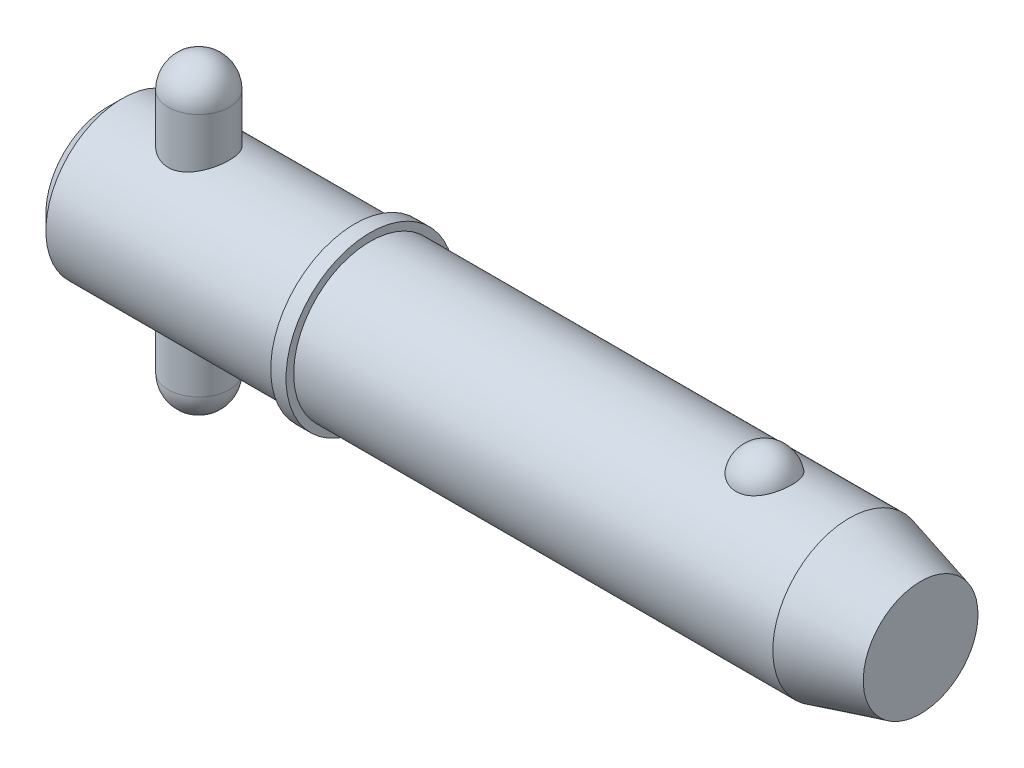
ISO-10303-21;
HEADER;
FILE_DESCRIPTION(('STEP AP214'),'2;1');
FILE_NAME('part.step','',(''),(''),'','','');
FILE_SCHEMA(('AUTOMOTIVE_DESIGN { 1 0 10303 214 1 1 1 1 }'));
ENDSEC;
DATA;
#1=APPLICATION_CONTEXT('core data for automotive mechanical design processes');
#2=APPLICATION_PROTOCOL_DEFINITION('international standard','automotive_design',2000,#1);
#3=PRODUCT_CONTEXT('',#1,'mechanical');
#4=PRODUCT('Part','Part','',(#3));
#5=PRODUCT_RELATED_PRODUCT_CATEGORY('part','',(#4));
#6=PRODUCT_DEFINITION_FORMATION('','',#4);
#7=PRODUCT_DEFINITION_CONTEXT('part definition',#1,'design');
#8=PRODUCT_DEFINITION('design','',#6,#7);
#9=PRODUCT_DEFINITION_SHAPE('','',#8);
#10=(LENGTH_UNIT() NAMED_UNIT(*) SI_UNIT(.MILLI.,.METRE.));
#11=(NAMED_UNIT(*) PLANE_ANGLE_UNIT() SI_UNIT($,.RADIAN.));
#12=(NAMED_UNIT(*) SI_UNIT($,.STERADIAN.) SOLID_ANGLE_UNIT());
#13=UNCERTAINTY_MEASURE_WITH_UNIT(LENGTH_MEASURE(1.E-05),#10,'distance_accuracy_value','');
#14=(GEOMETRIC_REPRESENTATION_CONTEXT(3) GLOBAL_UNCERTAINTY_ASSIGNED_CONTEXT((#13)) GLOBAL_UNIT_ASSIGNED_CONTEXT((#10,
#11,#12)) REPRESENTATION_CONTEXT('',''));
#15=CARTESIAN_POINT('',(0.,0.,0.));
#16=DIRECTION('',(0.,0.,1.));
#17=DIRECTION('',(1.,0.,0.));
#18=AXIS2_PLACEMENT_3D('',#15,#16,#17);
#19=CARTESIAN_POINT('',(9.525,15.875,0.));
#20=DIRECTION('',(0.,-1.,0.));
#21=DIRECTION('',(0.,0.,-1.));
#22=AXIS2_PLACEMENT_3D('',#19,#20,#21);
#23=CYLINDRICAL_SURFACE('',#22,3.175);
#24=CARTESIAN_POINT('',(9.525,-12.7,0.));
#25=DIRECTION('',(0.,-1.,0.));
#26=DIRECTION('',(0.,0.,-1.));
#27=AXIS2_PLACEMENT_3D('',#24,#25,#26);
#28=CIRCLE('',#27,3.175);
#29=CARTESIAN_POINT('',(9.525,-12.7,-3.175));
#30=VERTEX_POINT('',#29);
#31=EDGE_CURVE('P0_E10',#30,#30,#28,.F.);
#32=ORIENTED_EDGE('',*,*,#31,.T.);
#33=EDGE_LOOP('',(#32));
#34=FACE_BOUND('',#33,.T.);
#35=CARTESIAN_POINT('',(9.525,12.7,0.));
#36=DIRECTION('',(0.,-1.,0.));
#37=DIRECTION('',(0.,0.,-1.));
#38=AXIS2_PLACEMENT_3D('',#35,#36,#37);
#39=CIRCLE('',#38,3.175);
#40=CARTESIAN_POINT('',(9.525,12.7,-3.175));
#41=VERTEX_POINT('',#40);
#42=EDGE_CURVE('P0_E21',#41,#41,#39,.T.);
#43=ORIENTED_EDGE('',*,*,#42,.T.);
#44=EDGE_LOOP('',(#43));
#45=FACE_BOUND('',#44,.T.);
#46=ADVANCED_FACE('P0_F14',(#34,#45),#23,.T.);
#47=CARTESIAN_POINT('',(9.525,-12.7,0.));
#48=DIRECTION('',(0.,0.,1.));
#49=DIRECTION('',(1.,0.,0.));
#50=AXIS2_PLACEMENT_3D('',#47,#48,#49);
#51=SPHERICAL_SURFACE('',#50,3.175);
#52=CARTESIAN_POINT('',(9.525,-12.7,0.));
#53=DIRECTION('',(0.,-1.,0.));
#54=DIRECTION('',(0.,0.,-1.));
#55=AXIS2_PLACEMENT_3D('',#52,#53,#54);
#56=SPHERICAL_SURFACE('',#55,3.175);
#57=ORIENTED_EDGE('',*,*,#31,.F.);
#58=EDGE_LOOP('',(#57));
#59=FACE_BOUND('',#58,.T.);
#60=ADVANCED_FACE('P0_F29',(#59),#56,.T.);
#61=CARTESIAN_POINT('',(9.525,12.7,0.));
#62=DIRECTION('',(0.,0.,1.));
#63=DIRECTION('',(1.,0.,0.));
#64=AXIS2_PLACEMENT_3D('',#61,#62,#63);
#65=SPHERICAL_SURFACE('',#64,3.175);
#66=CARTESIAN_POINT('',(9.525,12.7,0.));
#67=DIRECTION('',(0.,-1.,0.));
#68=DIRECTION('',(0.,0.,-1.));
#69=AXIS2_PLACEMENT_3D('',#66,#67,#68);
#70=SPHERICAL_SURFACE('',#69,3.175);
#71=ORIENTED_EDGE('',*,*,#42,.F.);
#72=EDGE_LOOP('',(#71));
#73=FACE_BOUND('',#72,.T.);
#74=ADVANCED_FACE('P0_F16',(#73),#70,.T.);
#75=CLOSED_SHELL('',(#46,#60,#74));
#76=MANIFOLD_SOLID_BREP('P0_B1',#75);
#77=CARTESIAN_POINT('',(0.,0.,0.));
#78=DIRECTION('',(1.,0.,0.));
#79=DIRECTION('',(0.,0.,-1.));
#80=AXIS2_PLACEMENT_3D('',#77,#78,#79);
#81=CYLINDRICAL_SURFACE('',#80,7.94);
#82=CARTESIAN_POINT('',(77.0518791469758,0.,0.));
#83=DIRECTION('',(1.,0.,0.));
#84=DIRECTION('',(0.,0.,-1.));
#85=AXIS2_PLACEMENT_3D('',#82,#83,#84);
#86=CIRCLE('',#85,7.94);
#87=CARTESIAN_POINT('',(77.0518791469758,0.,-7.94));
#88=VERTEX_POINT('',#87);
#89=EDGE_CURVE('P1_E81',#88,#88,#86,.T.);
#90=ORIENTED_EDGE('',*,*,#89,.F.);
#91=EDGE_LOOP('',(#90));
#92=FACE_BOUND('',#91,.T.);
#93=CARTESIAN_POINT('',(27.31,0.,0.));
#94=DIRECTION('',(1.,0.,0.));
#95=DIRECTION('',(0.,0.,-1.));
#96=AXIS2_PLACEMENT_3D('',#93,#94,#95);
#97=CIRCLE('',#96,7.94);
#98=CARTESIAN_POINT('',(27.31,0.,-7.94));
#99=VERTEX_POINT('',#98);
#100=EDGE_CURVE('P1_E85',#99,#99,#97,.T.);
#101=ORIENTED_EDGE('',*,*,#100,.T.);
#102=EDGE_LOOP('',(#101));
#103=FACE_BOUND('',#102,.T.);
#104=CARTESIAN_POINT('',(68.2449074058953,7.37767842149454,2.93486986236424));
#105=CARTESIAN_POINT('',(68.0927496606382,7.37767329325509,2.9348750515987));
#106=CARTESIAN_POINT('',(67.9406329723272,7.38258419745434,2.92262454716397));
#107=CARTESIAN_POINT('',(67.6409284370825,7.40163229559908,2.87404196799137));
#108=CARTESIAN_POINT('',(67.4933394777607,7.41576720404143,2.83771585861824));
#109=CARTESIAN_POINT('',(67.2070187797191,7.45161576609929,2.74218769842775));
#110=CARTESIAN_POINT('',(67.0682745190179,7.47331841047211,2.68301886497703));
#111=CARTESIAN_POINT('',(66.8028822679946,7.52194082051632,2.54350967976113));
#112=CARTESIAN_POINT('',(66.6762366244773,7.54886159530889,2.46316523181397));
#113=CARTESIAN_POINT('',(66.4345349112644,7.60594671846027,2.28090375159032));
#114=CARTESIAN_POINT('',(66.3199065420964,7.63618114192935,2.1784421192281));
#115=CARTESIAN_POINT('',(66.1088787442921,7.69614046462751,1.95608495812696));
#116=CARTESIAN_POINT('',(66.0124826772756,7.72586526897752,1.83618622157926));
#117=CARTESIAN_POINT('',(65.8359381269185,7.78314821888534,1.57628086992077));
#118=CARTESIAN_POINT('',(65.7567072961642,7.81055035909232,1.43561546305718));
#119=CARTESIAN_POINT('',(65.6217979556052,7.85879631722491,1.14236334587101));
#120=CARTESIAN_POINT('',(65.5661216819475,7.87963951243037,0.98977550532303));
#121=CARTESIAN_POINT('',(65.4788121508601,7.91289645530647,0.674619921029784));
#122=CARTESIAN_POINT('',(65.4475309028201,7.92518652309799,0.511941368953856));
#123=CARTESIAN_POINT('',(65.4109756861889,7.93958930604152,0.18324773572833));
#124=CARTESIAN_POINT('',(65.4057012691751,7.94170219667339,0.0172327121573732));
#125=CARTESIAN_POINT('',(65.4212311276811,7.93554931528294,-0.312672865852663));
#126=CARTESIAN_POINT('',(65.4419253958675,7.92732732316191,-0.476569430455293));
#127=CARTESIAN_POINT('',(65.5087865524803,7.90141534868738,-0.798305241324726));
#128=CARTESIAN_POINT('',(65.5549539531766,7.88372517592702,-0.95614436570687));
#129=CARTESIAN_POINT('',(65.6718986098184,7.84066230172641,-1.26152073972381));
#130=CARTESIAN_POINT('',(65.7427046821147,7.81528060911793,-1.40904568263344));
#131=CARTESIAN_POINT('',(65.9074789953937,7.7594867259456,-1.68950598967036));
#132=CARTESIAN_POINT('',(66.0014488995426,7.72907417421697,-1.82244030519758));
#133=CARTESIAN_POINT('',(66.2108391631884,7.66640424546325,-2.07032792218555));
#134=CARTESIAN_POINT('',(66.3263152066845,7.63414223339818,-2.1852330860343));
#135=CARTESIAN_POINT('',(66.5759006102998,7.57149681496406,-2.39329737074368));
#136=CARTESIAN_POINT('',(66.7100080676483,7.54111321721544,-2.48645870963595));
#137=CARTESIAN_POINT('',(66.9901113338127,7.48650742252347,-2.64628132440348));
#138=CARTESIAN_POINT('',(67.1357605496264,7.46215900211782,-2.71350554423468));
#139=CARTESIAN_POINT('',(67.4374259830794,7.42171253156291,-2.82226614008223));
#140=CARTESIAN_POINT('',(67.5934383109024,7.40561140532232,-2.86381209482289));
#141=CARTESIAN_POINT('',(67.9029708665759,7.3842679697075,-2.91839077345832));
#142=CARTESIAN_POINT('',(68.0562229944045,7.37852109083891,-2.93275024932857));
#143=CARTESIAN_POINT('',(68.3630705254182,7.37700973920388,-2.93655208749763));
#144=CARTESIAN_POINT('',(68.5166658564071,7.38124333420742,-2.92599927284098));
#145=CARTESIAN_POINT('',(68.8149907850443,7.39890635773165,-2.88102897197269));
#146=CARTESIAN_POINT('',(68.9598480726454,7.41205491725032,-2.84733999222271));
#147=CARTESIAN_POINT('',(69.2416432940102,7.44580110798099,-2.75788206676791));
#148=CARTESIAN_POINT('',(69.3785805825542,7.46639934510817,-2.70211132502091));
#149=CARTESIAN_POINT('',(69.6440619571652,7.51339098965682,-2.56858908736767));
#150=CARTESIAN_POINT('',(69.7723548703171,7.5399020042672,-2.49038067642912));
#151=CARTESIAN_POINT('',(70.0142440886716,7.59569503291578,-2.31462737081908));
#152=CARTESIAN_POINT('',(70.1278370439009,7.6249776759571,-2.21707808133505));
#153=CARTESIAN_POINT('',(70.34322156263,7.68489473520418,-1.99982049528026));
#154=CARTESIAN_POINT('',(70.4441488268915,7.71552419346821,-1.87925337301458));
#155=CARTESIAN_POINT('',(70.6251866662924,7.77353016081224,-1.62268826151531));
#156=CARTESIAN_POINT('',(70.7052934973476,7.80090608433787,-1.48668750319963));
#157=CARTESIAN_POINT('',(70.8453615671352,7.85047992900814,-1.19818413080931));
#158=CARTESIAN_POINT('',(70.9045877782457,7.87248183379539,-1.04529016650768));
#159=CARTESIAN_POINT('',(70.9979821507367,7.90785114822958,-0.731080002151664));
#160=CARTESIAN_POINT('',(71.0321497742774,7.92121837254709,-0.569763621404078));
#161=CARTESIAN_POINT('',(71.074795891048,7.93797834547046,-0.24281228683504));
#162=CARTESIAN_POINT('',(71.0832047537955,7.94134405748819,-0.0771668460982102));
#163=CARTESIAN_POINT('',(71.0739626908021,7.93767937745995,0.253276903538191));
#164=CARTESIAN_POINT('',(71.0563120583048,7.93064910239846,0.418075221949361));
#165=CARTESIAN_POINT('',(70.995424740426,7.90695571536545,0.74152553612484));
#166=CARTESIAN_POINT('',(70.9522819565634,7.8903279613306,0.900197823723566));
#167=CARTESIAN_POINT('',(70.8413535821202,7.84916386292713,1.20759654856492));
#168=CARTESIAN_POINT('',(70.77356656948,7.82462706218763,1.35632241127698));
#169=CARTESIAN_POINT('',(70.6143718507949,7.7700669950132,1.64032869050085));
#170=CARTESIAN_POINT('',(70.5228616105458,7.7400200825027,1.77554712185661));
#171=CARTESIAN_POINT('',(70.3182960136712,7.67774175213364,2.02800648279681));
#172=CARTESIAN_POINT('',(70.2052410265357,7.64551037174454,2.14524772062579));
#173=CARTESIAN_POINT('',(69.9608318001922,7.58265895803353,2.35778002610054));
#174=CARTESIAN_POINT('',(69.8295833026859,7.55203092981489,2.45319004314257));
#175=CARTESIAN_POINT('',(69.551601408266,7.49579792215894,2.61999897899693));
#176=CARTESIAN_POINT('',(69.4048670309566,7.47019326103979,2.69139637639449));
#177=CARTESIAN_POINT('',(69.0929477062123,7.42622216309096,2.81053241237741));
#178=CARTESIAN_POINT('',(68.9272209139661,7.40825002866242,2.85700910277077));
#179=CARTESIAN_POINT('',(68.5892792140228,7.38398348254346,2.91916850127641));
#180=CARTESIAN_POINT('',(68.4170670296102,7.37768422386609,2.93486399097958));
#181=CARTESIAN_POINT('',(68.2449074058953,7.37767842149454,2.93486986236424));
#182=B_SPLINE_CURVE_WITH_KNOTS('',3,(#104,#105,#106,#107,#108,#109,#110,#111,#112,#113,#114,
#115,#116,#117,#118,#119,#120,#121,#122,#123,#124,#125,#126,#127,#128,#129,#130,#131,#132,#133,
#134,#135,#136,#137,#138,#139,#140,#141,#142,#143,#144,#145,#146,#147,#148,#149,#150,#151,#152,
#153,#154,#155,#156,#157,#158,#159,#160,#161,#162,#163,#164,#165,#166,#167,#168,#169,#170,#171,
#172,#173,#174,#175,#176,#177,#178,#179,#180,#181),.UNSPECIFIED.,.T.,.F.,(4,2,2,2,2,2,2,2,2,2,2,
2,2,2,2,2,2,2,2,2,2,2,2,2,2,2,2,2,2,2,2,2,2,2,2,2,2,2,4),(0.,0.455841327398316,
0.911569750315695,1.36663794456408,1.82179423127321,2.28978983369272,2.75787163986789,
3.246853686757,3.73588214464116,4.23184282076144,4.72779494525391,5.22165321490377,
5.71552141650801,6.20996917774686,6.70445245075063,7.200234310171,7.69596557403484,
8.18023418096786,8.66432203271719,9.12410697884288,9.58380291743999,10.0296503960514,
10.475534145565,10.9312349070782,11.3870393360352,11.8654416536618,12.3439299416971,
12.8378875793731,13.3318558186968,13.8271581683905,14.3224549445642,14.8159385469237,
15.3094506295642,15.8051323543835,16.3008055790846,16.7937101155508,17.2866458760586,
17.8026240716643,18.3183879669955),.UNSPECIFIED.);
#183=CARTESIAN_POINT('',(68.2449074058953,7.37767842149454,2.93486986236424));
#184=VERTEX_POINT('',#183);
#185=EDGE_CURVE('P1_E35',#184,#184,#182,.T.);
#186=ORIENTED_EDGE('',*,*,#185,.T.);
#187=EDGE_LOOP('',(#186));
#188=FACE_BOUND('',#187,.T.);
#189=ADVANCED_FACE('P1_F13',(#92,#103,#188),#81,.T.);
#190=CARTESIAN_POINT('',(0.,0.,0.));
#191=DIRECTION('',(-1.,0.,0.));
#192=DIRECTION('',(0.,0.,1.));
#193=AXIS2_PLACEMENT_3D('',#190,#191,#192);
#194=PLANE('',#193);
#195=CARTESIAN_POINT('',(0.,0.,0.));
#196=DIRECTION('',(1.,0.,0.));
#197=DIRECTION('',(0.,0.,-1.));
#198=AXIS2_PLACEMENT_3D('',#195,#196,#197);
#199=CIRCLE('',#198,6.352);
#200=CARTESIAN_POINT('',(0.,0.,-6.352));
#201=VERTEX_POINT('',#200);
#202=EDGE_CURVE('P1_E9',#201,#201,#199,.T.);
#203=ORIENTED_EDGE('',*,*,#202,.F.);
#204=EDGE_LOOP('',(#203));
#205=FACE_BOUND('',#204,.T.);
#206=ADVANCED_FACE('P1_F15',(#205),#194,.T.);
#207=CARTESIAN_POINT('',(1.58799999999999,0.,0.));
#208=DIRECTION('',(1.,0.,0.));
#209=DIRECTION('',(0.,0.,-1.));
#210=AXIS2_PLACEMENT_3D('',#207,#208,#209);
#211=CONICAL_SURFACE('',#210,7.94,0.78539816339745);
#212=ORIENTED_EDGE('',*,*,#202,.T.);
#213=EDGE_LOOP('',(#212));
#214=FACE_BOUND('',#213,.T.);
#215=CARTESIAN_POINT('',(1.58799999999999,0.,0.));
#216=DIRECTION('',(1.,0.,0.));
#217=DIRECTION('',(0.,0.,-1.));
#218=AXIS2_PLACEMENT_3D('',#215,#216,#217);
#219=CIRCLE('',#218,7.94);
#220=CARTESIAN_POINT('',(1.58799999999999,0.,-7.94));
#221=VERTEX_POINT('',#220);
#222=EDGE_CURVE('P1_E26',#221,#221,#219,.T.);
#223=ORIENTED_EDGE('',*,*,#222,.F.);
#224=EDGE_LOOP('',(#223));
#225=FACE_BOUND('',#224,.T.);
#226=ADVANCED_FACE('P1_F77',(#214,#225),#211,.T.);
#227=CARTESIAN_POINT('',(0.,0.,0.));
#228=DIRECTION('',(1.,0.,0.));
#229=DIRECTION('',(0.,0.,-1.));
#230=AXIS2_PLACEMENT_3D('',#227,#228,#229);
#231=CYLINDRICAL_SURFACE('',#230,7.94);
#232=CARTESIAN_POINT('',(9.525,-7.27756655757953,3.175));
#233=CARTESIAN_POINT('',(9.43992346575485,-7.27756715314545,3.17499935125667));
#234=CARTESIAN_POINT('',(9.35481882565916,-7.27906496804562,3.1715736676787));
#235=CARTESIAN_POINT('',(9.18524505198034,-7.28499816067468,3.15791803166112));
#236=CARTESIAN_POINT('',(9.100776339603,-7.28943533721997,3.14768391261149));
#237=CARTESIAN_POINT('',(8.84895715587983,-7.30698881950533,3.10684226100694));
#238=CARTESIAN_POINT('',(8.6834173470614,-7.32434654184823,3.06609574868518));
#239=CARTESIAN_POINT('',(8.36278910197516,-7.36806950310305,2.95945910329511));
#240=CARTESIAN_POINT('',(8.20766386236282,-7.39440078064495,2.89366366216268));
#241=CARTESIAN_POINT('',(7.91065319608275,-7.45304562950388,2.73907413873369));
#242=CARTESIAN_POINT('',(7.76876488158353,-7.48535789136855,2.65028508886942));
#243=CARTESIAN_POINT('',(7.49411086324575,-7.55439482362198,2.44679888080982));
#244=CARTESIAN_POINT('',(7.36219910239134,-7.59126138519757,2.33099745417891));
#245=CARTESIAN_POINT('',(7.11904234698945,-7.66408045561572,2.07909838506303));
#246=CARTESIAN_POINT('',(7.00780457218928,-7.70003264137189,1.94299368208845));
#247=CARTESIAN_POINT('',(6.80492173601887,-7.76867514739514,1.64775981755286));
#248=CARTESIAN_POINT('',(6.71422139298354,-7.80118112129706,1.48793473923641));
#249=CARTESIAN_POINT('',(6.56135788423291,-7.85754918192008,1.15376269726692));
#250=CARTESIAN_POINT('',(6.49918311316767,-7.88141478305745,0.979421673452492));
#251=CARTESIAN_POINT('',(6.40818142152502,-7.91680873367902,0.630115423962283));
#252=CARTESIAN_POINT('',(6.3778864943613,-7.9288781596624,0.455588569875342));
#253=CARTESIAN_POINT('',(6.34677743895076,-7.94127547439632,0.103539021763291));
#254=CARTESIAN_POINT('',(6.34595232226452,-7.94160773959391,-0.0739825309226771));
#255=CARTESIAN_POINT('',(6.37300128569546,-7.93082261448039,-0.416371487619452));
#256=CARTESIAN_POINT('',(6.39926693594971,-7.92034690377,-0.581389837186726));
#257=CARTESIAN_POINT('',(6.47701615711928,-7.88998770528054,-0.904449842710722));
#258=CARTESIAN_POINT('',(6.52850157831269,-7.87010352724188,-1.06249098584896));
#259=CARTESIAN_POINT('',(6.65586120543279,-7.82249343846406,-1.36995769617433));
#260=CARTESIAN_POINT('',(6.73209124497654,-7.79465387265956,-1.51921754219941));
#261=CARTESIAN_POINT('',(6.90644286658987,-7.73389606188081,-1.80321183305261));
#262=CARTESIAN_POINT('',(7.00457194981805,-7.70097607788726,-1.93794127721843));
#263=CARTESIAN_POINT('',(7.22744086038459,-7.63084889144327,-2.19843606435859));
#264=CARTESIAN_POINT('',(7.35350432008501,-7.59350211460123,-2.3230330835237));
#265=CARTESIAN_POINT('',(7.62488266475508,-7.52039654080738,-2.54979642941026));
#266=CARTESIAN_POINT('',(7.77020381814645,-7.48463826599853,-2.65195542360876));
#267=CARTESIAN_POINT('',(8.08119298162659,-7.41780943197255,-2.83361305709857));
#268=CARTESIAN_POINT('',(8.24731937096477,-7.38689959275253,-2.91239105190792));
#269=CARTESIAN_POINT('',(8.59204539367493,-7.33515216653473,-3.04038913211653));
#270=CARTESIAN_POINT('',(8.77063684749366,-7.31430804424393,-3.08962840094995));
#271=CARTESIAN_POINT('',(9.12356982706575,-7.28663831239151,-3.15431018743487));
#272=CARTESIAN_POINT('',(9.29750494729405,-7.2790344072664,-3.17163284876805));
#273=CARTESIAN_POINT('',(9.64592502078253,-7.27648884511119,-3.17747282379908));
#274=CARTESIAN_POINT('',(9.82040979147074,-7.28154335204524,-3.16599886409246));
#275=CARTESIAN_POINT('',(10.1545374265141,-7.30294638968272,-3.11628310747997));
#276=CARTESIAN_POINT('',(10.3144598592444,-7.31863587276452,-3.0796016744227));
#277=CARTESIAN_POINT('',(10.625774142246,-7.35872371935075,-2.98253618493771));
#278=CARTESIAN_POINT('',(10.7771640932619,-7.38312401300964,-2.92214687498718));
#279=CARTESIAN_POINT('',(11.0739599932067,-7.4390944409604,-2.77664664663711));
#280=CARTESIAN_POINT('',(11.2188745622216,-7.47091513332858,-2.69063278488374));
#281=CARTESIAN_POINT('',(11.4928722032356,-7.53775867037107,-2.49724834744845));
#282=CARTESIAN_POINT('',(11.6219487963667,-7.57278281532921,-2.38986907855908));
#283=CARTESIAN_POINT('',(11.8705091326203,-7.64520845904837,-2.1474449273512));
#284=CARTESIAN_POINT('',(11.9885816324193,-7.68259462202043,-2.01094304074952));
#285=CARTESIAN_POINT('',(12.2003631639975,-7.75309951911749,-1.71917041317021));
#286=CARTESIAN_POINT('',(12.2940712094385,-7.78621808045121,-1.56389891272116));
#287=CARTESIAN_POINT('',(12.4541161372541,-7.84456050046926,-1.23845027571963));
#288=CARTESIAN_POINT('',(12.5204600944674,-7.86978639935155,-1.06827700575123));
#289=CARTESIAN_POINT('',(12.6231407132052,-7.90943635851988,-0.717928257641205));
#290=CARTESIAN_POINT('',(12.6594936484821,-7.92386627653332,-0.537758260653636));
#291=CARTESIAN_POINT('',(12.6992281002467,-7.93967263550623,-0.185201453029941));
#292=CARTESIAN_POINT('',(12.7046050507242,-7.94183891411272,-0.0130732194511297));
#293=CARTESIAN_POINT('',(12.6875036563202,-7.9350072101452,0.329549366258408));
#294=CARTESIAN_POINT('',(12.6650295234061,-7.92601091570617,0.500043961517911));
#295=CARTESIAN_POINT('',(12.5942896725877,-7.89825976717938,0.829196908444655));
#296=CARTESIAN_POINT('',(12.5468364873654,-7.87981280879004,0.988057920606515));
#297=CARTESIAN_POINT('',(12.4283390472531,-7.83513565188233,1.29553461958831));
#298=CARTESIAN_POINT('',(12.3572904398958,-7.8089040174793,1.44414841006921));
#299=CARTESIAN_POINT('',(12.1900822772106,-7.7497911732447,1.73412879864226));
#300=CARTESIAN_POINT('',(12.0929519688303,-7.71666737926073,1.87488510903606));
#301=CARTESIAN_POINT('',(11.8777894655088,-7.64775894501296,2.13869231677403));
#302=CARTESIAN_POINT('',(11.7597486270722,-7.61197320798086,2.26173585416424));
#303=CARTESIAN_POINT('',(11.4974896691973,-7.53902341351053,2.49449755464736));
#304=CARTESIAN_POINT('',(11.3521039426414,-7.50191102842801,2.60292060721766));
#305=CARTESIAN_POINT('',(11.0440201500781,-7.43289551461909,2.79392602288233));
#306=CARTESIAN_POINT('',(10.8813200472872,-7.40099299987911,2.87650534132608));
#307=CARTESIAN_POINT('',(10.558064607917,-7.3489506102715,3.00682739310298));
#308=CARTESIAN_POINT('',(10.398627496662,-7.32801197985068,3.05703164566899));
#309=CARTESIAN_POINT('',(10.0731242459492,-7.29639491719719,3.13175843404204));
#310=CARTESIAN_POINT('',(9.90707793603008,-7.28568789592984,3.15635254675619));
#311=CARTESIAN_POINT('',(9.70441566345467,-7.27968826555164,3.17013149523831));
#312=CARTESIAN_POINT('',(9.66856669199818,-7.27889378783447,3.17195593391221));
#313=CARTESIAN_POINT('',(9.59681348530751,-7.27783278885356,3.17439036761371));
#314=CARTESIAN_POINT('',(9.56090924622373,-7.27756630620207,3.17500027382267));
#315=CARTESIAN_POINT('',(9.525,-7.27756655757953,3.175));
#316=B_SPLINE_CURVE_WITH_KNOTS('',3,(#232,#233,#234,#235,#236,#237,#238,#239,#240,#241,#242,
#243,#244,#245,#246,#247,#248,#249,#250,#251,#252,#253,#254,#255,#256,#257,#258,#259,#260,#261,
#262,#263,#264,#265,#266,#267,#268,#269,#270,#271,#272,#273,#274,#275,#276,#277,#278,#279,#280,
#281,#282,#283,#284,#285,#286,#287,#288,#289,#290,#291,#292,#293,#294,#295,#296,#297,#298,#299,
#300,#301,#302,#303,#304,#305,#306,#307,#308,#309,#310,#311,#312,#313,#314,#315),.UNSPECIFIED.,
.T.,.F.,(4,2,2,2,2,2,2,2,2,2,2,2,2,2,2,2,2,2,2,2,2,2,2,2,2,2,2,2,2,2,2,2,2,2,2,2,2,2,2,2,2,4),
(0.,0.255187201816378,0.510530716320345,1.0218798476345,1.53131482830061,2.04063840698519,
2.57635929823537,3.11226692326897,3.66929090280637,4.22608806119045,4.75594400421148,
5.28560237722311,5.78552836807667,6.28549104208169,6.79298787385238,7.30065880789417,
7.8416422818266,8.38280228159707,8.93923025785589,9.49529647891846,10.0174074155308,
10.5393601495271,11.0316114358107,11.5239718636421,12.0362920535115,12.5488211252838,
13.0991799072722,13.6495609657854,14.1997996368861,14.7497395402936,15.2638187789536,
15.7778202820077,16.2760504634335,16.7743726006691,17.294711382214,17.8152657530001,
18.3680208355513,18.9208410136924,19.4240423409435,19.9258334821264,20.0335354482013,
20.1412452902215),.UNSPECIFIED.);
#317=CARTESIAN_POINT('',(9.525,-7.27756655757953,3.175));
#318=VERTEX_POINT('',#317);
#319=EDGE_CURVE('P1_E17',#318,#318,#316,.T.);
#320=ORIENTED_EDGE('',*,*,#319,.F.);
#321=EDGE_LOOP('',(#320));
#322=FACE_BOUND('',#321,.T.);
#323=CARTESIAN_POINT('',(9.525,7.27756655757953,3.175));
#324=CARTESIAN_POINT('',(9.61007653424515,7.27756715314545,3.17499935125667));
#325=CARTESIAN_POINT('',(9.69518117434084,7.27906496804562,3.1715736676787));
#326=CARTESIAN_POINT('',(9.86475494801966,7.28499816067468,3.15791803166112));
#327=CARTESIAN_POINT('',(9.949223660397,7.28943533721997,3.14768391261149));
#328=CARTESIAN_POINT('',(10.2010428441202,7.30698881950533,3.10684226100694));
#329=CARTESIAN_POINT('',(10.3665826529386,7.32434654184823,3.06609574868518));
#330=CARTESIAN_POINT('',(10.6872108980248,7.36806950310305,2.95945910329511));
#331=CARTESIAN_POINT('',(10.8423361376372,7.39440078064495,2.89366366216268));
#332=CARTESIAN_POINT('',(11.1393468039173,7.45304562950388,2.73907413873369));
#333=CARTESIAN_POINT('',(11.2812351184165,7.48535789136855,2.65028508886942));
#334=CARTESIAN_POINT('',(11.5558891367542,7.55439482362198,2.44679888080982));
#335=CARTESIAN_POINT('',(11.6878008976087,7.59126138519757,2.33099745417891));
#336=CARTESIAN_POINT('',(11.9309576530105,7.66408045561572,2.07909838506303));
#337=CARTESIAN_POINT('',(12.0421954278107,7.70003264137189,1.94299368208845));
#338=CARTESIAN_POINT('',(12.2450782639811,7.76867514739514,1.64775981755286));
#339=CARTESIAN_POINT('',(12.3357786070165,7.80118112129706,1.48793473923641));
#340=CARTESIAN_POINT('',(12.4886421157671,7.85754918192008,1.15376269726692));
#341=CARTESIAN_POINT('',(12.5508168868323,7.88141478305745,0.979421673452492));
#342=CARTESIAN_POINT('',(12.641818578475,7.91680873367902,0.630115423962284));
#343=CARTESIAN_POINT('',(12.6721135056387,7.9288781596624,0.455588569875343));
#344=CARTESIAN_POINT('',(12.7032225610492,7.94127547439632,0.103539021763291));
#345=CARTESIAN_POINT('',(12.7040476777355,7.94160773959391,-0.0739825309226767));
#346=CARTESIAN_POINT('',(12.6769987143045,7.93082261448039,-0.416371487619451));
#347=CARTESIAN_POINT('',(12.6507330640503,7.92034690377,-0.581389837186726));
#348=CARTESIAN_POINT('',(12.5729838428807,7.88998770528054,-0.904449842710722));
#349=CARTESIAN_POINT('',(12.5214984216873,7.87010352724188,-1.06249098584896));
#350=CARTESIAN_POINT('',(12.3941387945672,7.82249343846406,-1.36995769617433));
#351=CARTESIAN_POINT('',(12.3179087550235,7.79465387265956,-1.51921754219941));
#352=CARTESIAN_POINT('',(12.1435571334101,7.73389606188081,-1.80321183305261));
#353=CARTESIAN_POINT('',(12.0454280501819,7.70097607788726,-1.93794127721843));
#354=CARTESIAN_POINT('',(11.8225591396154,7.63084889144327,-2.19843606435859));
#355=CARTESIAN_POINT('',(11.696495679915,7.59350211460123,-2.3230330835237));
#356=CARTESIAN_POINT('',(11.4251173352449,7.52039654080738,-2.54979642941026));
#357=CARTESIAN_POINT('',(11.2797961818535,7.48463826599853,-2.65195542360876));
#358=CARTESIAN_POINT('',(10.9688070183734,7.41780943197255,-2.83361305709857));
#359=CARTESIAN_POINT('',(10.8026806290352,7.38689959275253,-2.91239105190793));
#360=CARTESIAN_POINT('',(10.4579546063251,7.33515216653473,-3.04038913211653));
#361=CARTESIAN_POINT('',(10.2793631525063,7.31430804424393,-3.08962840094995));
#362=CARTESIAN_POINT('',(9.92643017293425,7.28663831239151,-3.15431018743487));
#363=CARTESIAN_POINT('',(9.75249505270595,7.2790344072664,-3.17163284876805));
#364=CARTESIAN_POINT('',(9.40407497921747,7.2764888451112,-3.17747282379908));
#365=CARTESIAN_POINT('',(9.22959020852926,7.28154335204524,-3.16599886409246));
#366=CARTESIAN_POINT('',(8.89546257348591,7.30294638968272,-3.11628310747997));
#367=CARTESIAN_POINT('',(8.73554014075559,7.31863587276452,-3.0796016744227));
#368=CARTESIAN_POINT('',(8.42422585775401,7.35872371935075,-2.98253618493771));
#369=CARTESIAN_POINT('',(8.27283590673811,7.38312401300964,-2.92214687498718));
#370=CARTESIAN_POINT('',(7.97604000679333,7.4390944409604,-2.77664664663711));
#371=CARTESIAN_POINT('',(7.83112543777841,7.47091513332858,-2.69063278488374));
#372=CARTESIAN_POINT('',(7.55712779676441,7.53775867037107,-2.49724834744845));
#373=CARTESIAN_POINT('',(7.42805120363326,7.57278281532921,-2.38986907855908));
#374=CARTESIAN_POINT('',(7.17949086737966,7.64520845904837,-2.1474449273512));
#375=CARTESIAN_POINT('',(7.06141836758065,7.68259462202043,-2.01094304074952));
#376=CARTESIAN_POINT('',(6.8496368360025,7.75309951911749,-1.71917041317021));
#377=CARTESIAN_POINT('',(6.75592879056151,7.78621808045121,-1.56389891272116));
#378=CARTESIAN_POINT('',(6.59588386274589,7.84456050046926,-1.23845027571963));
#379=CARTESIAN_POINT('',(6.52953990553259,7.86978639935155,-1.06827700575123));
#380=CARTESIAN_POINT('',(6.42685928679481,7.90943635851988,-0.717928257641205));
#381=CARTESIAN_POINT('',(6.39050635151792,7.92386627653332,-0.537758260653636));
#382=CARTESIAN_POINT('',(6.35077189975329,7.93967263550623,-0.18520145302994));
#383=CARTESIAN_POINT('',(6.34539494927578,7.94183891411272,-0.0130732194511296));
#384=CARTESIAN_POINT('',(6.36249634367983,7.9350072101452,0.329549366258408));
#385=CARTESIAN_POINT('',(6.38497047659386,7.92601091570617,0.500043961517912));
#386=CARTESIAN_POINT('',(6.45571032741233,7.89825976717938,0.829196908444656));
#387=CARTESIAN_POINT('',(6.50316351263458,7.87981280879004,0.988057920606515));
#388=CARTESIAN_POINT('',(6.62166095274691,7.83513565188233,1.29553461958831));
#389=CARTESIAN_POINT('',(6.69270956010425,7.8089040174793,1.44414841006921));
#390=CARTESIAN_POINT('',(6.85991772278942,7.7497911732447,1.73412879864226));
#391=CARTESIAN_POINT('',(6.95704803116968,7.71666737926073,1.87488510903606));
#392=CARTESIAN_POINT('',(7.17221053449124,7.64775894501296,2.13869231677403));
#393=CARTESIAN_POINT('',(7.29025137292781,7.61197320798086,2.26173585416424));
#394=CARTESIAN_POINT('',(7.55251033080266,7.53902341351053,2.49449755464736));
#395=CARTESIAN_POINT('',(7.69789605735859,7.50191102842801,2.60292060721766));
#396=CARTESIAN_POINT('',(8.00597984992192,7.43289551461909,2.79392602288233));
#397=CARTESIAN_POINT('',(8.16867995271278,7.40099299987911,2.87650534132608));
#398=CARTESIAN_POINT('',(8.49193539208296,7.3489506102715,3.00682739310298));
#399=CARTESIAN_POINT('',(8.65137250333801,7.32801197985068,3.05703164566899));
#400=CARTESIAN_POINT('',(8.97687575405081,7.29639491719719,3.13175843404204));
#401=CARTESIAN_POINT('',(9.14292206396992,7.28568789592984,3.15635254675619));
#402=CARTESIAN_POINT('',(9.34558433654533,7.27968826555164,3.17013149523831));
#403=CARTESIAN_POINT('',(9.38143330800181,7.27889378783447,3.17195593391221));
#404=CARTESIAN_POINT('',(9.45318651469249,7.27783278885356,3.17439036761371));
#405=CARTESIAN_POINT('',(9.48909075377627,7.27756630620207,3.17500027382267));
#406=CARTESIAN_POINT('',(9.525,7.27756655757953,3.175));
#407=B_SPLINE_CURVE_WITH_KNOTS('',3,(#323,#324,#325,#326,#327,#328,#329,#330,#331,#332,#333,
#334,#335,#336,#337,#338,#339,#340,#341,#342,#343,#344,#345,#346,#347,#348,#349,#350,#351,#352,
#353,#354,#355,#356,#357,#358,#359,#360,#361,#362,#363,#364,#365,#366,#367,#368,#369,#370,#371,
#372,#373,#374,#375,#376,#377,#378,#379,#380,#381,#382,#383,#384,#385,#386,#387,#388,#389,#390,
#391,#392,#393,#394,#395,#396,#397,#398,#399,#400,#401,#402,#403,#404,#405,#406),.UNSPECIFIED.,
.T.,.F.,(4,2,2,2,2,2,2,2,2,2,2,2,2,2,2,2,2,2,2,2,2,2,2,2,2,2,2,2,2,2,2,2,2,2,2,2,2,2,2,2,2,4),
(0.,0.255187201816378,0.510530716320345,1.0218798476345,1.53131482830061,2.04063840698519,
2.57635929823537,3.11226692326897,3.66929090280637,4.22608806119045,4.75594400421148,
5.2856023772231,5.78552836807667,6.28549104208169,6.79298787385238,7.30065880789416,
7.8416422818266,8.38280228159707,8.9392302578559,9.49529647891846,10.0174074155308,
10.5393601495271,11.0316114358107,11.5239718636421,12.0362920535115,12.5488211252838,
13.0991799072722,13.6495609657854,14.1997996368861,14.7497395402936,15.2638187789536,
15.7778202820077,16.2760504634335,16.7743726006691,17.294711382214,17.8152657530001,
18.3680208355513,18.9208410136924,19.4240423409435,19.9258334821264,20.0335354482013,
20.1412452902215),.UNSPECIFIED.);
#408=CARTESIAN_POINT('',(9.525,7.27756655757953,3.175));
#409=VERTEX_POINT('',#408);
#410=EDGE_CURVE('P1_E43',#409,#409,#407,.T.);
#411=ORIENTED_EDGE('',*,*,#410,.F.);
#412=EDGE_LOOP('',(#411));
#413=FACE_BOUND('',#412,.T.);
#414=ORIENTED_EDGE('',*,*,#222,.T.);
#415=EDGE_LOOP('',(#414));
#416=FACE_BOUND('',#415,.T.);
#417=CARTESIAN_POINT('',(25.722,0.,0.));
#418=DIRECTION('',(1.,0.,0.));
#419=DIRECTION('',(0.,0.,-1.));
#420=AXIS2_PLACEMENT_3D('',#417,#418,#419);
#421=CIRCLE('',#420,7.94);
#422=CARTESIAN_POINT('',(25.722,0.,-7.94));
#423=VERTEX_POINT('',#422);
#424=EDGE_CURVE('P1_E31',#423,#423,#421,.T.);
#425=ORIENTED_EDGE('',*,*,#424,.F.);
#426=EDGE_LOOP('',(#425));
#427=FACE_BOUND('',#426,.T.);
#428=ADVANCED_FACE('P1_F103',(#322,#413,#416,#427),#231,.T.);
#429=CARTESIAN_POINT('',(25.722,7.94,0.));
#430=DIRECTION('',(-1.,0.,0.));
#431=DIRECTION('',(0.,0.,1.));
#432=AXIS2_PLACEMENT_3D('',#429,#430,#431);
#433=PLANE('',#432);
#434=ORIENTED_EDGE('',*,*,#424,.T.);
#435=EDGE_LOOP('',(#434));
#436=FACE_BOUND('',#435,.T.);
#437=CARTESIAN_POINT('',(25.722,0.,0.));
#438=DIRECTION('',(1.,0.,0.));
#439=DIRECTION('',(0.,0.,-1.));
#440=AXIS2_PLACEMENT_3D('',#437,#438,#439);
#441=CIRCLE('',#440,8.734);
#442=CARTESIAN_POINT('',(25.722,0.,-8.734));
#443=VERTEX_POINT('',#442);
#444=EDGE_CURVE('P1_E91',#443,#443,#441,.T.);
#445=ORIENTED_EDGE('',*,*,#444,.F.);
#446=EDGE_LOOP('',(#445));
#447=FACE_BOUND('',#446,.T.);
#448=ADVANCED_FACE('P1_F100',(#436,#447),#433,.T.);
#449=CARTESIAN_POINT('',(0.,0.,0.));
#450=DIRECTION('',(1.,0.,0.));
#451=DIRECTION('',(0.,0.,-1.));
#452=AXIS2_PLACEMENT_3D('',#449,#450,#451);
#453=CYLINDRICAL_SURFACE('',#452,8.734);
#454=ORIENTED_EDGE('',*,*,#444,.T.);
#455=EDGE_LOOP('',(#454));
#456=FACE_BOUND('',#455,.T.);
#457=CARTESIAN_POINT('',(27.31,0.,0.));
#458=DIRECTION('',(1.,0.,0.));
#459=DIRECTION('',(0.,0.,-1.));
#460=AXIS2_PLACEMENT_3D('',#457,#458,#459);
#461=CIRCLE('',#460,8.734);
#462=CARTESIAN_POINT('',(27.31,0.,-8.734));
#463=VERTEX_POINT('',#462);
#464=EDGE_CURVE('P1_E88',#463,#463,#461,.T.);
#465=ORIENTED_EDGE('',*,*,#464,.F.);
#466=EDGE_LOOP('',(#465));
#467=FACE_BOUND('',#466,.T.);
#468=ADVANCED_FACE('P1_F68',(#456,#467),#453,.T.);
#469=CARTESIAN_POINT('',(27.31,8.734,0.));
#470=DIRECTION('',(1.,0.,0.));
#471=DIRECTION('',(0.,0.,-1.));
#472=AXIS2_PLACEMENT_3D('',#469,#470,#471);
#473=PLANE('',#472);
#474=ORIENTED_EDGE('',*,*,#464,.T.);
#475=EDGE_LOOP('',(#474));
#476=FACE_BOUND('',#475,.T.);
#477=ORIENTED_EDGE('',*,*,#100,.F.);
#478=EDGE_LOOP('',(#477));
#479=FACE_BOUND('',#478,.T.);
#480=ADVANCED_FACE('P1_F62',(#476,#479),#473,.T.);
#481=CARTESIAN_POINT('',(84.46,0.,0.));
#482=DIRECTION('',(-1.,0.,0.));
#483=DIRECTION('',(0.,0.,1.));
#484=AXIS2_PLACEMENT_3D('',#481,#482,#483);
#485=CONICAL_SURFACE('',#484,5.95500000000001,0.26179938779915);
#486=ORIENTED_EDGE('',*,*,#89,.T.);
#487=EDGE_LOOP('',(#486));
#488=FACE_BOUND('',#487,.T.);
#489=CARTESIAN_POINT('',(84.46,0.,0.));
#490=DIRECTION('',(1.,0.,0.));
#491=DIRECTION('',(0.,0.,-1.));
#492=AXIS2_PLACEMENT_3D('',#489,#490,#491);
#493=CIRCLE('',#492,5.95500000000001);
#494=CARTESIAN_POINT('',(84.46,0.,-5.95500000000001));
#495=VERTEX_POINT('',#494);
#496=EDGE_CURVE('P1_E42',#495,#495,#493,.T.);
#497=ORIENTED_EDGE('',*,*,#496,.F.);
#498=EDGE_LOOP('',(#497));
#499=FACE_BOUND('',#498,.T.);
#500=ADVANCED_FACE('P1_F59',(#488,#499),#485,.T.);
#501=CARTESIAN_POINT('',(84.46,5.95500000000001,0.));
#502=DIRECTION('',(1.,0.,0.));
#503=DIRECTION('',(0.,0.,-1.));
#504=AXIS2_PLACEMENT_3D('',#501,#502,#503);
#505=PLANE('',#504);
#506=ORIENTED_EDGE('',*,*,#496,.T.);
#507=EDGE_LOOP('',(#506));
#508=FACE_BOUND('',#507,.T.);
#509=ADVANCED_FACE('P1_F55',(#508),#505,.T.);
#510=CARTESIAN_POINT('',(68.2449074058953,7.146,0.));
#511=DIRECTION('',(-1.,0.,0.));
#512=DIRECTION('',(0.,1.,0.));
#513=AXIS2_PLACEMENT_3D('',#510,#511,#512);
#514=SPHERICAL_SURFACE('',#513,2.94400000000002);
#515=ORIENTED_EDGE('',*,*,#185,.F.);
#516=EDGE_LOOP('',(#515));
#517=FACE_BOUND('',#516,.T.);
#518=ADVANCED_FACE('P1_F50',(#517),#514,.T.);
#519=CARTESIAN_POINT('',(9.525,-8.734,0.));
#520=DIRECTION('',(0.,1.,0.));
#521=DIRECTION('',(0.,0.,1.));
#522=AXIS2_PLACEMENT_3D('',#519,#520,#521);
#523=CYLINDRICAL_SURFACE('',#522,3.175);
#524=ORIENTED_EDGE('',*,*,#319,.T.);
#525=EDGE_LOOP('',(#524));
#526=FACE_BOUND('',#525,.T.);
#527=ORIENTED_EDGE('',*,*,#410,.T.);
#528=EDGE_LOOP('',(#527));
#529=FACE_BOUND('',#528,.T.);
#530=ADVANCED_FACE('P1_F54',(#526,#529),#523,.F.);
#531=CLOSED_SHELL('',(#189,#206,#226,#428,#448,#468,#480,#500,#509,#518,#530));
#532=MANIFOLD_SOLID_BREP('P1_B1',#531);
#533=ADVANCED_BREP_SHAPE_REPRESENTATION('',(#18,#76,#532),#14);
#534=SHAPE_DEFINITION_REPRESENTATION(#9,#533);
ENDSEC;
END-ISO-10303-21;
